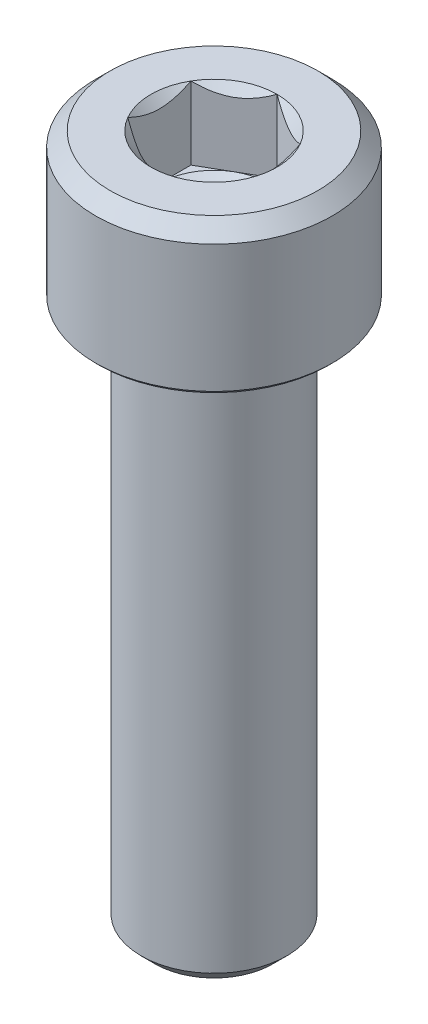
ISO-10303-21;
HEADER;
FILE_DESCRIPTION(('STEP AP214'),'2;1');
FILE_NAME('part.step','',(''),(''),'','','');
FILE_SCHEMA(('AUTOMOTIVE_DESIGN { 1 0 10303 214 1 1 1 1 }'));
ENDSEC;
DATA;
#1=APPLICATION_CONTEXT('core data for automotive mechanical design processes');
#2=APPLICATION_PROTOCOL_DEFINITION('international standard','automotive_design',2000,#1);
#3=PRODUCT_CONTEXT('',#1,'mechanical');
#4=PRODUCT('Part','Part','',(#3));
#5=PRODUCT_RELATED_PRODUCT_CATEGORY('part','',(#4));
#6=PRODUCT_DEFINITION_FORMATION('','',#4);
#7=PRODUCT_DEFINITION_CONTEXT('part definition',#1,'design');
#8=PRODUCT_DEFINITION('design','',#6,#7);
#9=PRODUCT_DEFINITION_SHAPE('','',#8);
#10=(LENGTH_UNIT() NAMED_UNIT(*) SI_UNIT(.MILLI.,.METRE.));
#11=(NAMED_UNIT(*) PLANE_ANGLE_UNIT() SI_UNIT($,.RADIAN.));
#12=(NAMED_UNIT(*) SI_UNIT($,.STERADIAN.) SOLID_ANGLE_UNIT());
#13=UNCERTAINTY_MEASURE_WITH_UNIT(LENGTH_MEASURE(1.E-05),#10,'distance_accuracy_value','');
#14=(GEOMETRIC_REPRESENTATION_CONTEXT(3) GLOBAL_UNCERTAINTY_ASSIGNED_CONTEXT((#13)) GLOBAL_UNIT_ASSIGNED_CONTEXT((#10,
#11,#12)) REPRESENTATION_CONTEXT('',''));
#15=CARTESIAN_POINT('',(0.,0.,0.));
#16=DIRECTION('',(0.,0.,1.));
#17=DIRECTION('',(1.,0.,0.));
#18=AXIS2_PLACEMENT_3D('',#15,#16,#17);
#19=CARTESIAN_POINT('',(0.,8.,0.));
#20=DIRECTION('',(0.,1.,0.));
#21=DIRECTION('',(0.,0.,1.));
#22=AXIS2_PLACEMENT_3D('',#19,#20,#21);
#23=CONICAL_SURFACE('',#22,3.4641016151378,0.785398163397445);
#24=CARTESIAN_POINT('',(0.,8.,0.));
#25=DIRECTION('',(0.,1.,0.));
#26=DIRECTION('',(0.,0.,1.));
#27=AXIS2_PLACEMENT_3D('',#24,#25,#26);
#28=CIRCLE('',#27,3.4641016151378);
#29=CARTESIAN_POINT('',(0.,8.,-3.4641016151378));
#30=VERTEX_POINT('',#29);
#31=CARTESIAN_POINT('',(-3.,8.,-1.73205080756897));
#32=VERTEX_POINT('',#31);
#33=EDGE_CURVE('E242',#30,#32,#28,.T.);
#34=ORIENTED_EDGE('',*,*,#33,.T.);
#35=CARTESIAN_POINT('',(-3.0002,8.00011547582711,-1.73193533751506));
#36=CARTESIAN_POINT('',(-2.89707648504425,7.94062831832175,-1.79147372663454));
#37=CARTESIAN_POINT('',(-2.79222861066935,7.88463497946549,-1.85200767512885));
#38=CARTESIAN_POINT('',(-2.57843232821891,7.78211259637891,-1.97544301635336));
#39=CARTESIAN_POINT('',(-2.46946358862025,7.73564059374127,-2.0383561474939));
#40=CARTESIAN_POINT('',(-2.24973336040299,7.65603318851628,-2.16521745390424));
#41=CARTESIAN_POINT('',(-2.13902782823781,7.62269770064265,-2.22913332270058));
#42=CARTESIAN_POINT('',(-1.9151795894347,7.57133754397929,-2.35837216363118));
#43=CARTESIAN_POINT('',(-1.80204372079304,7.55327453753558,-2.42369118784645));
#44=CARTESIAN_POINT('',(-1.60705904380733,7.53697690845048,-2.536265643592));
#45=CARTESIAN_POINT('',(-1.5254620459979,7.53456436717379,-2.58337569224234));
#46=CARTESIAN_POINT('',(-1.36240077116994,7.53862943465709,-2.67751916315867));
#47=CARTESIAN_POINT('',(-1.28093655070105,7.54511016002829,-2.72455255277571));
#48=CARTESIAN_POINT('',(-1.11877988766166,7.5665917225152,-2.81817374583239));
#49=CARTESIAN_POINT('',(-1.03808841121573,7.58160208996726,-2.86476099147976));
#50=CARTESIAN_POINT('',(-0.878091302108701,7.61932364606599,-2.95713536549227));
#51=CARTESIAN_POINT('',(-0.79878556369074,7.64203424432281,-3.00292255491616));
#52=CARTESIAN_POINT('',(-0.65799385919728,7.68876068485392,-3.08420868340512));
#53=CARTESIAN_POINT('',(-0.596196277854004,7.71154832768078,-3.11988753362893));
#54=CARTESIAN_POINT('',(-0.473710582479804,7.76079628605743,-3.19060468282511));
#55=CARTESIAN_POINT('',(-0.413022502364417,7.78725671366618,-3.22564296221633));
#56=CARTESIAN_POINT('',(-0.292947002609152,7.84325699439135,-3.29496858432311));
#57=CARTESIAN_POINT('',(-0.233556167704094,7.87278716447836,-3.32925789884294));
#58=CARTESIAN_POINT('',(-0.115874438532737,7.93453909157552,-3.39720147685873));
#59=CARTESIAN_POINT('',(-0.0575828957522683,7.96675919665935,-3.43085611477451));
#60=CARTESIAN_POINT('',(0.000200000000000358,8.00011547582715,-3.46421708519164));
#61=B_SPLINE_CURVE_WITH_KNOTS('',3,(#35,#36,#37,#38,#39,#40,#41,#42,#43,#44,#45,#46,#47,#48,#49,
#50,#51,#52,#53,#54,#55,#56,#57,#58,#59,#60),.UNSPECIFIED.,.F.,.F.,(4,2,2,2,2,2,2,2,2,2,2,2,4),
(0.,0.399603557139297,0.801535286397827,1.1970836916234,1.59163620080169,1.87398941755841,
2.15644160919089,2.43921001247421,2.72195674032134,2.94657516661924,3.17120044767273,
3.3951375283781,3.6189380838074),.UNSPECIFIED.);
#62=EDGE_CURVE('E125',#32,#30,#61,.T.);
#63=ORIENTED_EDGE('',*,*,#62,.T.);
#64=EDGE_LOOP('',(#34,#63));
#65=FACE_BOUND('',#64,.T.);
#66=ADVANCED_FACE('F33',(#65),#23,.F.);
#67=CARTESIAN_POINT('',(3.,8.,-1.7320508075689));
#68=VERTEX_POINT('',#67);
#69=EDGE_CURVE('E247',#68,#30,#28,.T.);
#70=ORIENTED_EDGE('',*,*,#69,.T.);
#71=CARTESIAN_POINT('',(-0.000200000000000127,8.00011547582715,-3.46421708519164));
#72=CARTESIAN_POINT('',(0.102923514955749,7.94062831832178,-3.40467869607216));
#73=CARTESIAN_POINT('',(0.207771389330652,7.88463497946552,-3.34414474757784));
#74=CARTESIAN_POINT('',(0.4215676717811,7.78211259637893,-3.22070940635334));
#75=CARTESIAN_POINT('',(0.530536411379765,7.73564059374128,-3.15779627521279));
#76=CARTESIAN_POINT('',(0.750266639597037,7.65603318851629,-3.03093496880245));
#77=CARTESIAN_POINT('',(0.860972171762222,7.62269770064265,-2.9670191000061));
#78=CARTESIAN_POINT('',(1.08482041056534,7.57133754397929,-2.83778025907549));
#79=CARTESIAN_POINT('',(1.19795627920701,7.55327453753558,-2.77246123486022));
#80=CARTESIAN_POINT('',(1.39294095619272,7.53697690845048,-2.65988677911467));
#81=CARTESIAN_POINT('',(1.47453795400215,7.53456436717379,-2.61277673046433));
#82=CARTESIAN_POINT('',(1.6375992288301,7.53862943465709,-2.518633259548));
#83=CARTESIAN_POINT('',(1.719063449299,7.54511016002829,-2.47159986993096));
#84=CARTESIAN_POINT('',(1.88122011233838,7.5665917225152,-2.37797867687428));
#85=CARTESIAN_POINT('',(1.96191158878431,7.58160208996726,-2.33139143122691));
#86=CARTESIAN_POINT('',(2.12190869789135,7.61932364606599,-2.23901705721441));
#87=CARTESIAN_POINT('',(2.20121443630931,7.64203424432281,-2.19322986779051));
#88=CARTESIAN_POINT('',(2.34200614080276,7.68876068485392,-2.11194373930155));
#89=CARTESIAN_POINT('',(2.40380372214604,7.71154832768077,-2.07626488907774));
#90=CARTESIAN_POINT('',(2.52628941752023,7.76079628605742,-2.00554773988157));
#91=CARTESIAN_POINT('',(2.58697749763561,7.78725671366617,-1.97050946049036));
#92=CARTESIAN_POINT('',(2.70705299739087,7.84325699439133,-1.90118383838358));
#93=CARTESIAN_POINT('',(2.76644383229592,7.87278716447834,-1.86689452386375));
#94=CARTESIAN_POINT('',(2.88412556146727,7.93453909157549,-1.79895094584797));
#95=CARTESIAN_POINT('',(2.94241710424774,7.96675919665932,-1.76529630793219));
#96=CARTESIAN_POINT('',(3.0002,8.00011547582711,-1.73193533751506));
#97=B_SPLINE_CURVE_WITH_KNOTS('',3,(#71,#72,#73,#74,#75,#76,#77,#78,#79,#80,#81,#82,#83,#84,#85,
#86,#87,#88,#89,#90,#91,#92,#93,#94,#95,#96),.UNSPECIFIED.,.F.,.F.,(4,2,2,2,2,2,2,2,2,2,2,2,4),
(0.,0.399603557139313,0.801535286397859,1.19708369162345,1.59163620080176,1.87398941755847,
2.15644160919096,2.43921001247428,2.72195674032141,2.94657516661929,3.17120044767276,
3.39513752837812,3.6189380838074),.UNSPECIFIED.);
#98=EDGE_CURVE('E201',#30,#68,#97,.T.);
#99=ORIENTED_EDGE('',*,*,#98,.T.);
#100=EDGE_LOOP('',(#70,#99));
#101=FACE_BOUND('',#100,.T.);
#102=ADVANCED_FACE('F233',(#101),#23,.F.);
#103=CARTESIAN_POINT('',(3.,8.,1.7320508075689));
#104=VERTEX_POINT('',#103);
#105=EDGE_CURVE('E249',#104,#68,#28,.T.);
#106=ORIENTED_EDGE('',*,*,#105,.T.);
#107=CARTESIAN_POINT('',(3.,9.23330992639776,-3.61464731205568));
#108=CARTESIAN_POINT('',(3.,9.16612617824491,-3.52731912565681));
#109=CARTESIAN_POINT('',(3.,9.09954444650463,-3.43952039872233));
#110=CARTESIAN_POINT('',(3.,8.96786005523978,-3.26278953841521));
#111=CARTESIAN_POINT('',(3.,8.90275774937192,-3.17385714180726));
#112=CARTESIAN_POINT('',(3.,8.77384395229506,-2.99401672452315));
#113=CARTESIAN_POINT('',(3.,8.71004629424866,-2.90309875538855));
#114=CARTESIAN_POINT('',(3.,8.58467115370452,-2.71974967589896));
#115=CARTESIAN_POINT('',(3.,8.52309351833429,-2.6273186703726));
#116=CARTESIAN_POINT('',(3.,8.39884594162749,-2.43477191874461));
#117=CARTESIAN_POINT('',(3.,8.33635431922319,-2.33454052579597));
#118=CARTESIAN_POINT('',(3.,8.21524983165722,-2.13172396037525));
#119=CARTESIAN_POINT('',(3.,8.15663761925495,-2.02913839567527));
#120=CARTESIAN_POINT('',(3.,8.04454018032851,-1.8215854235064));
#121=CARTESIAN_POINT('',(3.,7.99103990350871,-1.71662620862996));
#122=CARTESIAN_POINT('',(3.,7.89036499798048,-1.50374068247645));
#123=CARTESIAN_POINT('',(3.,7.843187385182,-1.3958158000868));
#124=CARTESIAN_POINT('',(3.,7.7611273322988,-1.18757170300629));
#125=CARTESIAN_POINT('',(3.,7.72549107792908,-1.0875525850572));
#126=CARTESIAN_POINT('',(3.,7.66222448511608,-0.884966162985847));
#127=CARTESIAN_POINT('',(3.,7.63459465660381,-0.782398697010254));
#128=CARTESIAN_POINT('',(3.,7.58929703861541,-0.577114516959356));
#129=CARTESIAN_POINT('',(3.,7.57144831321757,-0.474438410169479));
#130=CARTESIAN_POINT('',(3.,7.54608525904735,-0.26781053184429));
#131=CARTESIAN_POINT('',(3.,7.53856878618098,-0.163859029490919));
#132=CARTESIAN_POINT('',(3.,7.53451050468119,0.0397130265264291));
#133=CARTESIAN_POINT('',(3.,7.53750360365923,0.139324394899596));
#134=CARTESIAN_POINT('',(3.,7.55323151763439,0.337769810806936));
#135=CARTESIAN_POINT('',(3.,7.56596721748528,0.436603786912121));
#136=CARTESIAN_POINT('',(3.,7.60067669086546,0.634454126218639));
#137=CARTESIAN_POINT('',(3.,7.62281356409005,0.733441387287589));
#138=CARTESIAN_POINT('',(3.,7.67509725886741,0.929236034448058));
#139=CARTESIAN_POINT('',(3.,7.70524362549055,1.0260435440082));
#140=CARTESIAN_POINT('',(3.,7.77415433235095,1.22281850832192));
#141=CARTESIAN_POINT('',(3.,7.81331606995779,1.32264520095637));
#142=CARTESIAN_POINT('',(3.,7.89768452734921,1.5197178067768));
#143=CARTESIAN_POINT('',(3.,7.94289318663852,1.61696287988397));
#144=CARTESIAN_POINT('',(3.,8.03829112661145,1.80935238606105));
#145=CARTESIAN_POINT('',(3.,8.08849610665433,1.90448897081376));
#146=CARTESIAN_POINT('',(3.,8.19277781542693,2.09258005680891));
#147=CARTESIAN_POINT('',(3.,8.24685386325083,2.18553493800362));
#148=CARTESIAN_POINT('',(3.,8.35537605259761,2.36500752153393));
#149=CARTESIAN_POINT('',(3.,8.40967211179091,2.4516164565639));
#150=CARTESIAN_POINT('',(3.,8.52057534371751,2.62334631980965));
#151=CARTESIAN_POINT('',(3.,8.57718268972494,2.70846713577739));
#152=CARTESIAN_POINT('',(3.,8.69183550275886,2.87673108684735));
#153=CARTESIAN_POINT('',(3.,8.74986577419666,2.95988461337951));
#154=CARTESIAN_POINT('',(3.,8.86748190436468,3.12505091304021));
#155=CARTESIAN_POINT('',(3.,8.92706732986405,3.20706399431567));
#156=CARTESIAN_POINT('',(3.,8.98728932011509,3.28859867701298));
#157=B_SPLINE_CURVE_WITH_KNOTS('',3,(#107,#108,#109,#110,#111,#112,#113,#114,#115,#116,#117,
#118,#119,#120,#121,#122,#123,#124,#125,#126,#127,#128,#129,#130,#131,#132,#133,#134,#135,#136,
#137,#138,#139,#140,#141,#142,#143,#144,#145,#146,#147,#148,#149,#150,#151,#152,#153,#154,#155,
#156),.UNSPECIFIED.,.F.,.F.,(4,2,2,2,2,2,2,2,2,2,2,2,2,2,2,2,2,2,2,2,2,2,2,2,4),(0.,
0.330549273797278,0.661176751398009,0.994354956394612,1.32751017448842,1.68179021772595,
2.03612972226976,2.38939159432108,2.74248614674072,3.06074559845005,3.37902531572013,
3.69119941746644,4.0033087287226,4.30178328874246,4.60028496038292,4.90419165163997,
5.20808108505,5.52953489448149,5.85109205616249,6.17369358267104,6.4962385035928,
6.80285904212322,7.10950260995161,7.41368417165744,7.71778188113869),.UNSPECIFIED.);
#158=EDGE_CURVE('E195',#68,#104,#157,.T.);
#159=ORIENTED_EDGE('',*,*,#158,.T.);
#160=EDGE_LOOP('',(#106,#159));
#161=FACE_BOUND('',#160,.T.);
#162=ADVANCED_FACE('F238',(#161),#23,.F.);
#163=CARTESIAN_POINT('',(0.,8.,3.4641016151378));
#164=VERTEX_POINT('',#163);
#165=EDGE_CURVE('E251',#164,#104,#28,.T.);
#166=ORIENTED_EDGE('',*,*,#165,.T.);
#167=CARTESIAN_POINT('',(3.0002,8.00011547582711,1.73193533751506));
#168=CARTESIAN_POINT('',(2.89707648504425,7.94062831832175,1.79147372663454));
#169=CARTESIAN_POINT('',(2.79222861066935,7.88463497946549,1.85200767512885));
#170=CARTESIAN_POINT('',(2.57843232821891,7.78211259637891,1.97544301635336));
#171=CARTESIAN_POINT('',(2.46946358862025,7.73564059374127,2.0383561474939));
#172=CARTESIAN_POINT('',(2.24973336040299,7.65603318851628,2.16521745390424));
#173=CARTESIAN_POINT('',(2.13902782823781,7.62269770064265,2.22913332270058));
#174=CARTESIAN_POINT('',(1.9151795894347,7.57133754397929,2.35837216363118));
#175=CARTESIAN_POINT('',(1.80204372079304,7.55327453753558,2.42369118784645));
#176=CARTESIAN_POINT('',(1.60705904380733,7.53697690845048,2.536265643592));
#177=CARTESIAN_POINT('',(1.5254620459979,7.53456436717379,2.58337569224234));
#178=CARTESIAN_POINT('',(1.36240077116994,7.53862943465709,2.67751916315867));
#179=CARTESIAN_POINT('',(1.28093655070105,7.54511016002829,2.72455255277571));
#180=CARTESIAN_POINT('',(1.11877988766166,7.5665917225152,2.81817374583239));
#181=CARTESIAN_POINT('',(1.03808841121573,7.58160208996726,2.86476099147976));
#182=CARTESIAN_POINT('',(0.878091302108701,7.61932364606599,2.95713536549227));
#183=CARTESIAN_POINT('',(0.79878556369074,7.64203424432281,3.00292255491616));
#184=CARTESIAN_POINT('',(0.65799385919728,7.68876068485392,3.08420868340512));
#185=CARTESIAN_POINT('',(0.596196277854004,7.71154832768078,3.11988753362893));
#186=CARTESIAN_POINT('',(0.473710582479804,7.76079628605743,3.19060468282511));
#187=CARTESIAN_POINT('',(0.413022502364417,7.78725671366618,3.22564296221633));
#188=CARTESIAN_POINT('',(0.292947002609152,7.84325699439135,3.29496858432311));
#189=CARTESIAN_POINT('',(0.233556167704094,7.87278716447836,3.32925789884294));
#190=CARTESIAN_POINT('',(0.115874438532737,7.93453909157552,3.39720147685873));
#191=CARTESIAN_POINT('',(0.0575828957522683,7.96675919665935,3.43085611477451));
#192=CARTESIAN_POINT('',(-0.000200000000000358,8.00011547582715,3.46421708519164));
#193=B_SPLINE_CURVE_WITH_KNOTS('',3,(#167,#168,#169,#170,#171,#172,#173,#174,#175,#176,#177,
#178,#179,#180,#181,#182,#183,#184,#185,#186,#187,#188,#189,#190,#191,#192),.UNSPECIFIED.,.F.,
.F.,(4,2,2,2,2,2,2,2,2,2,2,2,4),(0.,0.399603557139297,0.801535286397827,1.1970836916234,
1.59163620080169,1.87398941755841,2.15644160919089,2.43921001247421,2.72195674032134,
2.94657516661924,3.17120044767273,3.3951375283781,3.6189380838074),.UNSPECIFIED.);
#194=EDGE_CURVE('E189',#104,#164,#193,.T.);
#195=ORIENTED_EDGE('',*,*,#194,.T.);
#196=EDGE_LOOP('',(#166,#195));
#197=FACE_BOUND('',#196,.T.);
#198=ADVANCED_FACE('F340',(#197),#23,.F.);
#199=CARTESIAN_POINT('',(-3.,8.,1.7320508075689));
#200=VERTEX_POINT('',#199);
#201=EDGE_CURVE('E250',#200,#164,#28,.T.);
#202=ORIENTED_EDGE('',*,*,#201,.T.);
#203=CARTESIAN_POINT('',(0.000200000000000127,8.00011547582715,3.46421708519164));
#204=CARTESIAN_POINT('',(-0.102923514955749,7.94062831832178,3.40467869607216));
#205=CARTESIAN_POINT('',(-0.207771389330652,7.88463497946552,3.34414474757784));
#206=CARTESIAN_POINT('',(-0.4215676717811,7.78211259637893,3.22070940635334));
#207=CARTESIAN_POINT('',(-0.530536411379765,7.73564059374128,3.15779627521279));
#208=CARTESIAN_POINT('',(-0.750266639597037,7.65603318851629,3.03093496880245));
#209=CARTESIAN_POINT('',(-0.860972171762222,7.62269770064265,2.9670191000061));
#210=CARTESIAN_POINT('',(-1.08482041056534,7.57133754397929,2.83778025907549));
#211=CARTESIAN_POINT('',(-1.19795627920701,7.55327453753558,2.77246123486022));
#212=CARTESIAN_POINT('',(-1.39294095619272,7.53697690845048,2.65988677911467));
#213=CARTESIAN_POINT('',(-1.47453795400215,7.53456436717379,2.61277673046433));
#214=CARTESIAN_POINT('',(-1.6375992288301,7.53862943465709,2.518633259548));
#215=CARTESIAN_POINT('',(-1.719063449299,7.54511016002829,2.47159986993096));
#216=CARTESIAN_POINT('',(-1.88122011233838,7.5665917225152,2.37797867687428));
#217=CARTESIAN_POINT('',(-1.96191158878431,7.58160208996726,2.33139143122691));
#218=CARTESIAN_POINT('',(-2.12190869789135,7.61932364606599,2.23901705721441));
#219=CARTESIAN_POINT('',(-2.20121443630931,7.64203424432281,2.19322986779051));
#220=CARTESIAN_POINT('',(-2.34200614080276,7.68876068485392,2.11194373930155));
#221=CARTESIAN_POINT('',(-2.40380372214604,7.71154832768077,2.07626488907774));
#222=CARTESIAN_POINT('',(-2.52628941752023,7.76079628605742,2.00554773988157));
#223=CARTESIAN_POINT('',(-2.58697749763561,7.78725671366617,1.97050946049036));
#224=CARTESIAN_POINT('',(-2.70705299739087,7.84325699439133,1.90118383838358));
#225=CARTESIAN_POINT('',(-2.76644383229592,7.87278716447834,1.86689452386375));
#226=CARTESIAN_POINT('',(-2.88412556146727,7.93453909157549,1.79895094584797));
#227=CARTESIAN_POINT('',(-2.94241710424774,7.96675919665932,1.76529630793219));
#228=CARTESIAN_POINT('',(-3.0002,8.00011547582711,1.73193533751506));
#229=B_SPLINE_CURVE_WITH_KNOTS('',3,(#203,#204,#205,#206,#207,#208,#209,#210,#211,#212,#213,
#214,#215,#216,#217,#218,#219,#220,#221,#222,#223,#224,#225,#226,#227,#228),.UNSPECIFIED.,.F.,
.F.,(4,2,2,2,2,2,2,2,2,2,2,2,4),(0.,0.399603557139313,0.801535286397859,1.19708369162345,
1.59163620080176,1.87398941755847,2.15644160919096,2.43921001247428,2.72195674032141,
2.94657516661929,3.17120044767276,3.39513752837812,3.6189380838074),.UNSPECIFIED.);
#230=EDGE_CURVE('E168',#164,#200,#229,.T.);
#231=ORIENTED_EDGE('',*,*,#230,.T.);
#232=EDGE_LOOP('',(#202,#231));
#233=FACE_BOUND('',#232,.T.);
#234=ADVANCED_FACE('F181',(#233),#23,.F.);
#235=EDGE_CURVE('E248',#32,#200,#28,.T.);
#236=ORIENTED_EDGE('',*,*,#235,.T.);
#237=CARTESIAN_POINT('',(-3.,9.23330992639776,-3.61464731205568));
#238=CARTESIAN_POINT('',(-3.,9.16612617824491,-3.52731912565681));
#239=CARTESIAN_POINT('',(-3.,9.09954444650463,-3.43952039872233));
#240=CARTESIAN_POINT('',(-3.,8.96786005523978,-3.26278953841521));
#241=CARTESIAN_POINT('',(-3.,8.90275774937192,-3.17385714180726));
#242=CARTESIAN_POINT('',(-3.,8.77384395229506,-2.99401672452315));
#243=CARTESIAN_POINT('',(-3.,8.71004629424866,-2.90309875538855));
#244=CARTESIAN_POINT('',(-3.,8.58467115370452,-2.71974967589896));
#245=CARTESIAN_POINT('',(-3.,8.52309351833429,-2.6273186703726));
#246=CARTESIAN_POINT('',(-3.,8.39884594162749,-2.43477191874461));
#247=CARTESIAN_POINT('',(-3.,8.33635431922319,-2.33454052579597));
#248=CARTESIAN_POINT('',(-3.,8.21524983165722,-2.13172396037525));
#249=CARTESIAN_POINT('',(-3.,8.15663761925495,-2.02913839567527));
#250=CARTESIAN_POINT('',(-3.,8.04454018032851,-1.8215854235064));
#251=CARTESIAN_POINT('',(-3.,7.99103990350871,-1.71662620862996));
#252=CARTESIAN_POINT('',(-3.,7.89036499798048,-1.50374068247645));
#253=CARTESIAN_POINT('',(-3.,7.843187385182,-1.3958158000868));
#254=CARTESIAN_POINT('',(-3.,7.7611273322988,-1.18757170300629));
#255=CARTESIAN_POINT('',(-3.,7.72549107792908,-1.0875525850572));
#256=CARTESIAN_POINT('',(-3.,7.66222448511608,-0.884966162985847));
#257=CARTESIAN_POINT('',(-3.,7.63459465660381,-0.782398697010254));
#258=CARTESIAN_POINT('',(-3.,7.58929703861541,-0.577114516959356));
#259=CARTESIAN_POINT('',(-3.,7.57144831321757,-0.474438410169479));
#260=CARTESIAN_POINT('',(-3.,7.54608525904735,-0.26781053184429));
#261=CARTESIAN_POINT('',(-3.,7.53856878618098,-0.163859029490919));
#262=CARTESIAN_POINT('',(-3.,7.53451050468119,0.0397130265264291));
#263=CARTESIAN_POINT('',(-3.,7.53750360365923,0.139324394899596));
#264=CARTESIAN_POINT('',(-3.,7.55323151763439,0.337769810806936));
#265=CARTESIAN_POINT('',(-3.,7.56596721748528,0.436603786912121));
#266=CARTESIAN_POINT('',(-3.,7.60067669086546,0.634454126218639));
#267=CARTESIAN_POINT('',(-3.,7.62281356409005,0.733441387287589));
#268=CARTESIAN_POINT('',(-3.,7.67509725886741,0.929236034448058));
#269=CARTESIAN_POINT('',(-3.,7.70524362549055,1.0260435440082));
#270=CARTESIAN_POINT('',(-3.,7.77415433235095,1.22281850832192));
#271=CARTESIAN_POINT('',(-3.,7.81331606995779,1.32264520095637));
#272=CARTESIAN_POINT('',(-3.,7.89768452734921,1.5197178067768));
#273=CARTESIAN_POINT('',(-3.,7.94289318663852,1.61696287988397));
#274=CARTESIAN_POINT('',(-3.,8.03829112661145,1.80935238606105));
#275=CARTESIAN_POINT('',(-3.,8.08849610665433,1.90448897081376));
#276=CARTESIAN_POINT('',(-3.,8.19277781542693,2.09258005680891));
#277=CARTESIAN_POINT('',(-3.,8.24685386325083,2.18553493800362));
#278=CARTESIAN_POINT('',(-3.,8.35537605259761,2.36500752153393));
#279=CARTESIAN_POINT('',(-3.,8.40967211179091,2.4516164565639));
#280=CARTESIAN_POINT('',(-3.,8.52057534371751,2.62334631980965));
#281=CARTESIAN_POINT('',(-3.,8.57718268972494,2.70846713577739));
#282=CARTESIAN_POINT('',(-3.,8.69183550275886,2.87673108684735));
#283=CARTESIAN_POINT('',(-3.,8.74986577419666,2.95988461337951));
#284=CARTESIAN_POINT('',(-3.,8.86748190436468,3.12505091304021));
#285=CARTESIAN_POINT('',(-3.,8.92706732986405,3.20706399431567));
#286=CARTESIAN_POINT('',(-3.,8.98728932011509,3.28859867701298));
#287=B_SPLINE_CURVE_WITH_KNOTS('',3,(#237,#238,#239,#240,#241,#242,#243,#244,#245,#246,#247,
#248,#249,#250,#251,#252,#253,#254,#255,#256,#257,#258,#259,#260,#261,#262,#263,#264,#265,#266,
#267,#268,#269,#270,#271,#272,#273,#274,#275,#276,#277,#278,#279,#280,#281,#282,#283,#284,#285,
#286),.UNSPECIFIED.,.F.,.F.,(4,2,2,2,2,2,2,2,2,2,2,2,2,2,2,2,2,2,2,2,2,2,2,2,4),(0.,
0.330549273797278,0.661176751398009,0.994354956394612,1.32751017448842,1.68179021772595,
2.03612972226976,2.38939159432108,2.74248614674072,3.06074559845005,3.37902531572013,
3.69119941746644,4.0033087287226,4.30178328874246,4.60028496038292,4.90419165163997,
5.20808108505,5.52953489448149,5.85109205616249,6.17369358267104,6.4962385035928,
6.80285904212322,7.10950260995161,7.41368417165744,7.71778188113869),.UNSPECIFIED.);
#288=EDGE_CURVE('E56',#200,#32,#287,.F.);
#289=ORIENTED_EDGE('',*,*,#288,.T.);
#290=EDGE_LOOP('',(#236,#289));
#291=FACE_BOUND('',#290,.T.);
#292=ADVANCED_FACE('F176',(#291),#23,.F.);
#293=CARTESIAN_POINT('',(3.4641016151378,8.,0.));
#294=DIRECTION('',(0.,-1.,0.));
#295=DIRECTION('',(0.,0.,-1.));
#296=AXIS2_PLACEMENT_3D('',#293,#294,#295);
#297=PLANE('',#296);
#298=ORIENTED_EDGE('',*,*,#165,.F.);
#299=ORIENTED_EDGE('',*,*,#201,.F.);
#300=ORIENTED_EDGE('',*,*,#235,.F.);
#301=ORIENTED_EDGE('',*,*,#33,.F.);
#302=ORIENTED_EDGE('',*,*,#69,.F.);
#303=ORIENTED_EDGE('',*,*,#105,.F.);
#304=EDGE_LOOP('',(#298,#299,#300,#301,#302,#303));
#305=FACE_BOUND('',#304,.T.);
#306=CARTESIAN_POINT('',(0.,8.,0.));
#307=DIRECTION('',(0.,1.,0.));
#308=DIRECTION('',(0.,0.,1.));
#309=AXIS2_PLACEMENT_3D('',#306,#307,#308);
#310=CIRCLE('',#309,5.7);
#311=CARTESIAN_POINT('',(0.,8.,5.7));
#312=VERTEX_POINT('',#311);
#313=EDGE_CURVE('E254',#312,#312,#310,.T.);
#314=ORIENTED_EDGE('',*,*,#313,.T.);
#315=EDGE_LOOP('',(#314));
#316=FACE_BOUND('',#315,.T.);
#317=ADVANCED_FACE('F180',(#305,#316),#297,.F.);
#318=CARTESIAN_POINT('',(0.,7.2,0.));
#319=DIRECTION('',(0.,-1.,0.));
#320=DIRECTION('',(0.,0.,-1.));
#321=AXIS2_PLACEMENT_3D('',#318,#319,#320);
#322=CONICAL_SURFACE('',#321,6.5,0.785398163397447);
#323=ORIENTED_EDGE('',*,*,#313,.F.);
#324=EDGE_LOOP('',(#323));
#325=FACE_BOUND('',#324,.T.);
#326=CARTESIAN_POINT('',(0.,7.2,0.));
#327=DIRECTION('',(0.,1.,0.));
#328=DIRECTION('',(0.,0.,1.));
#329=AXIS2_PLACEMENT_3D('',#326,#327,#328);
#330=CIRCLE('',#329,6.5);
#331=CARTESIAN_POINT('',(0.,7.2,6.5));
#332=VERTEX_POINT('',#331);
#333=EDGE_CURVE('E257',#332,#332,#330,.T.);
#334=ORIENTED_EDGE('',*,*,#333,.T.);
#335=EDGE_LOOP('',(#334));
#336=FACE_BOUND('',#335,.T.);
#337=ADVANCED_FACE('F311',(#325,#336),#322,.T.);
#338=CARTESIAN_POINT('',(0.,-30.,0.));
#339=DIRECTION('',(0.,1.,0.));
#340=DIRECTION('',(0.,0.,1.));
#341=AXIS2_PLACEMENT_3D('',#338,#339,#340);
#342=CYLINDRICAL_SURFACE('',#341,6.5);
#343=ORIENTED_EDGE('',*,*,#333,.F.);
#344=EDGE_LOOP('',(#343));
#345=FACE_BOUND('',#344,.T.);
#346=CARTESIAN_POINT('',(0.,0.199999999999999,0.));
#347=DIRECTION('',(0.,1.,0.));
#348=DIRECTION('',(0.,0.,1.));
#349=AXIS2_PLACEMENT_3D('',#346,#347,#348);
#350=CIRCLE('',#349,6.5);
#351=CARTESIAN_POINT('',(0.,0.199999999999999,6.5));
#352=VERTEX_POINT('',#351);
#353=EDGE_CURVE('E260',#352,#352,#350,.T.);
#354=ORIENTED_EDGE('',*,*,#353,.T.);
#355=EDGE_LOOP('',(#354));
#356=FACE_BOUND('',#355,.T.);
#357=ADVANCED_FACE('F308',(#345,#356),#342,.T.);
#358=CARTESIAN_POINT('',(0.,0.,0.));
#359=DIRECTION('',(0.,1.,0.));
#360=DIRECTION('',(0.,0.,1.));
#361=AXIS2_PLACEMENT_3D('',#358,#359,#360);
#362=CONICAL_SURFACE('',#361,6.3,0.785398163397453);
#363=ORIENTED_EDGE('',*,*,#353,.F.);
#364=EDGE_LOOP('',(#363));
#365=FACE_BOUND('',#364,.T.);
#366=CARTESIAN_POINT('',(0.,0.,0.));
#367=DIRECTION('',(0.,1.,0.));
#368=DIRECTION('',(0.,0.,1.));
#369=AXIS2_PLACEMENT_3D('',#366,#367,#368);
#370=CIRCLE('',#369,6.3);
#371=CARTESIAN_POINT('',(0.,0.,6.3));
#372=VERTEX_POINT('',#371);
#373=EDGE_CURVE('E263',#372,#372,#370,.T.);
#374=ORIENTED_EDGE('',*,*,#373,.T.);
#375=EDGE_LOOP('',(#374));
#376=FACE_BOUND('',#375,.T.);
#377=ADVANCED_FACE('F304',(#365,#376),#362,.T.);
#378=CARTESIAN_POINT('',(6.3,0.,0.));
#379=DIRECTION('',(0.,1.,0.));
#380=DIRECTION('',(0.,0.,1.));
#381=AXIS2_PLACEMENT_3D('',#378,#379,#380);
#382=PLANE('',#381);
#383=ORIENTED_EDGE('',*,*,#373,.F.);
#384=EDGE_LOOP('',(#383));
#385=FACE_BOUND('',#384,.T.);
#386=CARTESIAN_POINT('',(0.,0.,0.));
#387=DIRECTION('',(0.,1.,0.));
#388=DIRECTION('',(0.,0.,1.));
#389=AXIS2_PLACEMENT_3D('',#386,#387,#388);
#390=CIRCLE('',#389,4.05);
#391=CARTESIAN_POINT('',(0.,0.,4.05));
#392=VERTEX_POINT('',#391);
#393=EDGE_CURVE('E266',#392,#392,#390,.T.);
#394=ORIENTED_EDGE('',*,*,#393,.T.);
#395=EDGE_LOOP('',(#394));
#396=FACE_BOUND('',#395,.T.);
#397=ADVANCED_FACE('F300',(#385,#396),#382,.F.);
#398=CARTESIAN_POINT('',(0.,-1.02,0.));
#399=DIRECTION('',(0.,1.,0.));
#400=DIRECTION('',(0.,0.,1.));
#401=AXIS2_PLACEMENT_3D('',#398,#399,#400);
#402=CONICAL_SURFACE('',#401,4.,0.0489804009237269);
#403=ORIENTED_EDGE('',*,*,#393,.F.);
#404=EDGE_LOOP('',(#403));
#405=FACE_BOUND('',#404,.T.);
#406=CARTESIAN_POINT('',(0.,-1.02,0.));
#407=DIRECTION('',(0.,1.,0.));
#408=DIRECTION('',(0.,0.,1.));
#409=AXIS2_PLACEMENT_3D('',#406,#407,#408);
#410=CIRCLE('',#409,4.);
#411=CARTESIAN_POINT('',(0.,-1.02,4.));
#412=VERTEX_POINT('',#411);
#413=EDGE_CURVE('E269',#412,#412,#410,.T.);
#414=ORIENTED_EDGE('',*,*,#413,.T.);
#415=EDGE_LOOP('',(#414));
#416=FACE_BOUND('',#415,.T.);
#417=ADVANCED_FACE('F296',(#405,#416),#402,.T.);
#418=CARTESIAN_POINT('',(0.,-30.,0.));
#419=DIRECTION('',(0.,1.,0.));
#420=DIRECTION('',(0.,0.,1.));
#421=AXIS2_PLACEMENT_3D('',#418,#419,#420);
#422=CYLINDRICAL_SURFACE('',#421,4.);
#423=ORIENTED_EDGE('',*,*,#413,.F.);
#424=EDGE_LOOP('',(#423));
#425=FACE_BOUND('',#424,.T.);
#426=CARTESIAN_POINT('',(0.,-29.233,0.));
#427=DIRECTION('',(0.,1.,0.));
#428=DIRECTION('',(0.,0.,1.));
#429=AXIS2_PLACEMENT_3D('',#426,#427,#428);
#430=CIRCLE('',#429,4.);
#431=CARTESIAN_POINT('',(0.,-29.233,4.));
#432=VERTEX_POINT('',#431);
#433=EDGE_CURVE('E272',#432,#432,#430,.T.);
#434=ORIENTED_EDGE('',*,*,#433,.T.);
#435=EDGE_LOOP('',(#434));
#436=FACE_BOUND('',#435,.T.);
#437=ADVANCED_FACE('F289',(#425,#436),#422,.T.);
#438=CARTESIAN_POINT('',(0.,-30.,0.));
#439=DIRECTION('',(0.,1.,0.));
#440=DIRECTION('',(0.,0.,1.));
#441=AXIS2_PLACEMENT_3D('',#438,#439,#440);
#442=CONICAL_SURFACE('',#441,3.233,0.78539816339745);
#443=ORIENTED_EDGE('',*,*,#433,.F.);
#444=EDGE_LOOP('',(#443));
#445=FACE_BOUND('',#444,.T.);
#446=CARTESIAN_POINT('',(0.,-30.,0.));
#447=DIRECTION('',(0.,1.,0.));
#448=DIRECTION('',(0.,0.,1.));
#449=AXIS2_PLACEMENT_3D('',#446,#447,#448);
#450=CIRCLE('',#449,3.233);
#451=CARTESIAN_POINT('',(0.,-30.,3.233));
#452=VERTEX_POINT('',#451);
#453=EDGE_CURVE('E274',#452,#452,#450,.T.);
#454=ORIENTED_EDGE('',*,*,#453,.T.);
#455=EDGE_LOOP('',(#454));
#456=FACE_BOUND('',#455,.T.);
#457=ADVANCED_FACE('F278',(#445,#456),#442,.T.);
#458=CARTESIAN_POINT('',(3.233,-30.,0.));
#459=DIRECTION('',(0.,1.,0.));
#460=DIRECTION('',(0.,0.,1.));
#461=AXIS2_PLACEMENT_3D('',#458,#459,#460);
#462=PLANE('',#461);
#463=ORIENTED_EDGE('',*,*,#453,.F.);
#464=EDGE_LOOP('',(#463));
#465=FACE_BOUND('',#464,.T.);
#466=ADVANCED_FACE('F280',(#465),#462,.F.);
#467=CARTESIAN_POINT('',(-3.,4.,-1.7320508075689));
#468=DIRECTION('',(0.,1.,0.));
#469=DIRECTION('',(0.,0.,1.));
#470=AXIS2_PLACEMENT_3D('',#467,#468,#469);
#471=PLANE('',#470);
#472=CARTESIAN_POINT('',(0.,4.,0.));
#473=DIRECTION('',(0.,1.,0.));
#474=DIRECTION('',(0.,0.,1.));
#475=AXIS2_PLACEMENT_3D('',#472,#473,#474);
#476=CIRCLE('',#475,3.);
#477=CARTESIAN_POINT('',(-3.,4.,0.));
#478=VERTEX_POINT('',#477);
#479=CARTESIAN_POINT('',(-1.50000000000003,4.,2.59807621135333));
#480=VERTEX_POINT('',#479);
#481=EDGE_CURVE('E372',#478,#480,#476,.T.);
#482=ORIENTED_EDGE('',*,*,#481,.F.);
#483=DIRECTION('',(0.,0.,1.));
#484=VECTOR('',#483,1.);
#485=CARTESIAN_POINT('',(-3.,4.,-1.7320508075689));
#486=LINE('',#485,#484);
#487=CARTESIAN_POINT('',(-3.,4.,1.7320508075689));
#488=VERTEX_POINT('',#487);
#489=EDGE_CURVE('E134',#478,#488,#486,.T.);
#490=ORIENTED_EDGE('',*,*,#489,.T.);
#491=DIRECTION('',(0.866025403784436,0.,0.500000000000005));
#492=VECTOR('',#491,1.);
#493=CARTESIAN_POINT('',(-3.,4.,1.7320508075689));
#494=LINE('',#493,#492);
#495=EDGE_CURVE('E137',#488,#480,#494,.T.);
#496=ORIENTED_EDGE('',*,*,#495,.T.);
#497=EDGE_LOOP('',(#482,#490,#496));
#498=FACE_BOUND('',#497,.T.);
#499=ADVANCED_FACE('F216',(#498),#471,.T.);
#500=CARTESIAN_POINT('',(-1.50000000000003,4.,-2.59807621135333));
#501=VERTEX_POINT('',#500);
#502=EDGE_CURVE('E115',#501,#478,#476,.T.);
#503=ORIENTED_EDGE('',*,*,#502,.F.);
#504=DIRECTION('',(-0.866025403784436,0.,0.500000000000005));
#505=VECTOR('',#504,1.);
#506=CARTESIAN_POINT('',(0.,4.,-3.4641016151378));
#507=LINE('',#506,#505);
#508=CARTESIAN_POINT('',(-3.,4.,-1.7320508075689));
#509=VERTEX_POINT('',#508);
#510=EDGE_CURVE('E109',#501,#509,#507,.T.);
#511=ORIENTED_EDGE('',*,*,#510,.T.);
#512=EDGE_CURVE('E113',#509,#478,#486,.T.);
#513=ORIENTED_EDGE('',*,*,#512,.T.);
#514=EDGE_LOOP('',(#503,#511,#513));
#515=FACE_BOUND('',#514,.T.);
#516=ADVANCED_FACE('F111',(#515),#471,.T.);
#517=CARTESIAN_POINT('',(1.50000000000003,4.,-2.59807621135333));
#518=VERTEX_POINT('',#517);
#519=EDGE_CURVE('E369',#518,#501,#476,.T.);
#520=ORIENTED_EDGE('',*,*,#519,.F.);
#521=DIRECTION('',(-0.866025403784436,0.,-0.500000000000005));
#522=VECTOR('',#521,1.);
#523=CARTESIAN_POINT('',(3.,4.,-1.7320508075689));
#524=LINE('',#523,#522);
#525=CARTESIAN_POINT('',(0.,4.,-3.4641016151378));
#526=VERTEX_POINT('',#525);
#527=EDGE_CURVE('E147',#518,#526,#524,.T.);
#528=ORIENTED_EDGE('',*,*,#527,.T.);
#529=EDGE_CURVE('E119',#526,#501,#507,.T.);
#530=ORIENTED_EDGE('',*,*,#529,.T.);
#531=EDGE_LOOP('',(#520,#528,#530));
#532=FACE_BOUND('',#531,.T.);
#533=ADVANCED_FACE('F384',(#532),#471,.T.);
#534=CARTESIAN_POINT('',(3.,4.,0.));
#535=VERTEX_POINT('',#534);
#536=EDGE_CURVE('E41',#535,#518,#476,.T.);
#537=ORIENTED_EDGE('',*,*,#536,.F.);
#538=DIRECTION('',(0.,0.,-1.));
#539=VECTOR('',#538,1.);
#540=CARTESIAN_POINT('',(3.,4.,1.7320508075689));
#541=LINE('',#540,#539);
#542=CARTESIAN_POINT('',(3.,4.,-1.7320508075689));
#543=VERTEX_POINT('',#542);
#544=EDGE_CURVE('E143',#535,#543,#541,.T.);
#545=ORIENTED_EDGE('',*,*,#544,.T.);
#546=EDGE_CURVE('E129',#543,#518,#524,.T.);
#547=ORIENTED_EDGE('',*,*,#546,.T.);
#548=EDGE_LOOP('',(#537,#545,#547));
#549=FACE_BOUND('',#548,.T.);
#550=ADVANCED_FACE('F366',(#549),#471,.T.);
#551=CARTESIAN_POINT('',(1.50000000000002,4.,2.59807621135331));
#552=VERTEX_POINT('',#551);
#553=EDGE_CURVE('E11',#552,#535,#476,.T.);
#554=ORIENTED_EDGE('',*,*,#553,.F.);
#555=DIRECTION('',(0.866025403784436,0.,-0.500000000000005));
#556=VECTOR('',#555,1.);
#557=CARTESIAN_POINT('',(0.,4.,3.4641016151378));
#558=LINE('',#557,#556);
#559=CARTESIAN_POINT('',(3.,4.,1.7320508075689));
#560=VERTEX_POINT('',#559);
#561=EDGE_CURVE('E141',#552,#560,#558,.T.);
#562=ORIENTED_EDGE('',*,*,#561,.T.);
#563=EDGE_CURVE('E144',#560,#535,#541,.T.);
#564=ORIENTED_EDGE('',*,*,#563,.T.);
#565=EDGE_LOOP('',(#554,#562,#564));
#566=FACE_BOUND('',#565,.T.);
#567=ADVANCED_FACE('F375',(#566),#471,.T.);
#568=EDGE_CURVE('E42',#480,#552,#476,.T.);
#569=ORIENTED_EDGE('',*,*,#568,.F.);
#570=CARTESIAN_POINT('',(0.,4.,3.4641016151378));
#571=VERTEX_POINT('',#570);
#572=EDGE_CURVE('E135',#480,#571,#494,.T.);
#573=ORIENTED_EDGE('',*,*,#572,.T.);
#574=EDGE_CURVE('E49',#571,#552,#558,.T.);
#575=ORIENTED_EDGE('',*,*,#574,.T.);
#576=EDGE_LOOP('',(#569,#573,#575));
#577=FACE_BOUND('',#576,.T.);
#578=ADVANCED_FACE('F288',(#577),#471,.T.);
#579=CARTESIAN_POINT('',(0.,4.,-3.4641016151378));
#580=DIRECTION('',(-0.500000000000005,0.,-0.866025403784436));
#581=DIRECTION('',(-0.866025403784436,0.,0.500000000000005));
#582=AXIS2_PLACEMENT_3D('',#579,#580,#581);
#583=PLANE('',#582);
#584=ORIENTED_EDGE('',*,*,#62,.F.);
#585=DIRECTION('',(0.,1.,0.));
#586=VECTOR('',#585,1.);
#587=CARTESIAN_POINT('',(-3.,4.,-1.7320508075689));
#588=LINE('',#587,#586);
#589=EDGE_CURVE('E122',#509,#32,#588,.T.);
#590=ORIENTED_EDGE('',*,*,#589,.F.);
#591=ORIENTED_EDGE('',*,*,#510,.F.);
#592=ORIENTED_EDGE('',*,*,#529,.F.);
#593=DIRECTION('',(0.,1.,0.));
#594=VECTOR('',#593,1.);
#595=CARTESIAN_POINT('',(0.,4.,-3.4641016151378));
#596=LINE('',#595,#594);
#597=EDGE_CURVE('E150',#526,#30,#596,.T.);
#598=ORIENTED_EDGE('',*,*,#597,.T.);
#599=EDGE_LOOP('',(#584,#590,#591,#592,#598));
#600=FACE_BOUND('',#599,.T.);
#601=ADVANCED_FACE('F123',(#600),#583,.F.);
#602=CARTESIAN_POINT('',(3.,4.,-1.7320508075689));
#603=DIRECTION('',(0.500000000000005,0.,-0.866025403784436));
#604=DIRECTION('',(-0.866025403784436,0.,-0.500000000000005));
#605=AXIS2_PLACEMENT_3D('',#602,#603,#604);
#606=PLANE('',#605);
#607=ORIENTED_EDGE('',*,*,#98,.F.);
#608=ORIENTED_EDGE('',*,*,#597,.F.);
#609=ORIENTED_EDGE('',*,*,#527,.F.);
#610=ORIENTED_EDGE('',*,*,#546,.F.);
#611=DIRECTION('',(0.,1.,0.));
#612=VECTOR('',#611,1.);
#613=CARTESIAN_POINT('',(3.,4.,-1.7320508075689));
#614=LINE('',#613,#612);
#615=EDGE_CURVE('E152',#543,#68,#614,.T.);
#616=ORIENTED_EDGE('',*,*,#615,.T.);
#617=EDGE_LOOP('',(#607,#608,#609,#610,#616));
#618=FACE_BOUND('',#617,.T.);
#619=ADVANCED_FACE('F210',(#618),#606,.F.);
#620=CARTESIAN_POINT('',(3.,4.,1.7320508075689));
#621=DIRECTION('',(1.,0.,0.));
#622=DIRECTION('',(0.,0.,-1.));
#623=AXIS2_PLACEMENT_3D('',#620,#621,#622);
#624=PLANE('',#623);
#625=ORIENTED_EDGE('',*,*,#158,.F.);
#626=ORIENTED_EDGE('',*,*,#615,.F.);
#627=ORIENTED_EDGE('',*,*,#544,.F.);
#628=ORIENTED_EDGE('',*,*,#563,.F.);
#629=DIRECTION('',(0.,1.,0.));
#630=VECTOR('',#629,1.);
#631=CARTESIAN_POINT('',(3.,4.,1.7320508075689));
#632=LINE('',#631,#630);
#633=EDGE_CURVE('E155',#560,#104,#632,.T.);
#634=ORIENTED_EDGE('',*,*,#633,.T.);
#635=EDGE_LOOP('',(#625,#626,#627,#628,#634));
#636=FACE_BOUND('',#635,.T.);
#637=ADVANCED_FACE('F214',(#636),#624,.F.);
#638=CARTESIAN_POINT('',(0.,4.,3.4641016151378));
#639=DIRECTION('',(0.500000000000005,0.,0.866025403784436));
#640=DIRECTION('',(0.866025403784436,0.,-0.500000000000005));
#641=AXIS2_PLACEMENT_3D('',#638,#639,#640);
#642=PLANE('',#641);
#643=ORIENTED_EDGE('',*,*,#194,.F.);
#644=ORIENTED_EDGE('',*,*,#633,.F.);
#645=ORIENTED_EDGE('',*,*,#561,.F.);
#646=ORIENTED_EDGE('',*,*,#574,.F.);
#647=DIRECTION('',(0.,1.,0.));
#648=VECTOR('',#647,1.);
#649=CARTESIAN_POINT('',(0.,4.,3.4641016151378));
#650=LINE('',#649,#648);
#651=EDGE_CURVE('E158',#571,#164,#650,.T.);
#652=ORIENTED_EDGE('',*,*,#651,.T.);
#653=EDGE_LOOP('',(#643,#644,#645,#646,#652));
#654=FACE_BOUND('',#653,.T.);
#655=ADVANCED_FACE('F219',(#654),#642,.F.);
#656=CARTESIAN_POINT('',(-3.,4.,1.7320508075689));
#657=DIRECTION('',(-0.500000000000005,0.,0.866025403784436));
#658=DIRECTION('',(0.866025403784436,0.,0.500000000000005));
#659=AXIS2_PLACEMENT_3D('',#656,#657,#658);
#660=PLANE('',#659);
#661=ORIENTED_EDGE('',*,*,#230,.F.);
#662=ORIENTED_EDGE('',*,*,#651,.F.);
#663=ORIENTED_EDGE('',*,*,#572,.F.);
#664=ORIENTED_EDGE('',*,*,#495,.F.);
#665=DIRECTION('',(0.,1.,0.));
#666=VECTOR('',#665,1.);
#667=CARTESIAN_POINT('',(-3.,4.,1.7320508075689));
#668=LINE('',#667,#666);
#669=EDGE_CURVE('E128',#488,#200,#668,.T.);
#670=ORIENTED_EDGE('',*,*,#669,.T.);
#671=EDGE_LOOP('',(#661,#662,#663,#664,#670));
#672=FACE_BOUND('',#671,.T.);
#673=ADVANCED_FACE('F223',(#672),#660,.F.);
#674=CARTESIAN_POINT('',(-3.,4.,-1.7320508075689));
#675=DIRECTION('',(-1.,0.,0.));
#676=DIRECTION('',(0.,0.,1.));
#677=AXIS2_PLACEMENT_3D('',#674,#675,#676);
#678=PLANE('',#677);
#679=ORIENTED_EDGE('',*,*,#288,.F.);
#680=ORIENTED_EDGE('',*,*,#669,.F.);
#681=ORIENTED_EDGE('',*,*,#489,.F.);
#682=ORIENTED_EDGE('',*,*,#512,.F.);
#683=ORIENTED_EDGE('',*,*,#589,.T.);
#684=EDGE_LOOP('',(#679,#680,#681,#682,#683));
#685=FACE_BOUND('',#684,.T.);
#686=ADVANCED_FACE('F132',(#685),#678,.F.);
#687=CARTESIAN_POINT('',(0.,4.,0.));
#688=DIRECTION('',(0.,1.,0.));
#689=DIRECTION('',(0.,0.,1.));
#690=AXIS2_PLACEMENT_3D('',#687,#688,#689);
#691=CONICAL_SURFACE('',#690,3.,1.04719755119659);
#692=CARTESIAN_POINT('',(0.,2.2679491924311,0.));
#693=VERTEX_POINT('',#692);
#694=VERTEX_LOOP('',#693);
#695=FACE_BOUND('',#694,.T.);
#696=ORIENTED_EDGE('',*,*,#553,.T.);
#697=ORIENTED_EDGE('',*,*,#536,.T.);
#698=ORIENTED_EDGE('',*,*,#519,.T.);
#699=ORIENTED_EDGE('',*,*,#502,.T.);
#700=ORIENTED_EDGE('',*,*,#481,.T.);
#701=ORIENTED_EDGE('',*,*,#568,.T.);
#702=EDGE_LOOP('',(#696,#697,#698,#699,#700,#701));
#703=FACE_BOUND('',#702,.T.);
#704=ADVANCED_FACE('F35',(#695,#703),#691,.F.);
#705=CLOSED_SHELL('',(#66,#102,#162,#198,#234,#292,#317,#337,#357,#377,#397,#417,#437,#457,#466,
#499,#516,#533,#550,#567,#578,#601,#619,#637,#655,#673,#686,#704));
#706=MANIFOLD_SOLID_BREP('B2',#705);
#707=ADVANCED_BREP_SHAPE_REPRESENTATION('',(#18,#706),#14);
#708=SHAPE_DEFINITION_REPRESENTATION(#9,#707);
ENDSEC;
END-ISO-10303-21;
